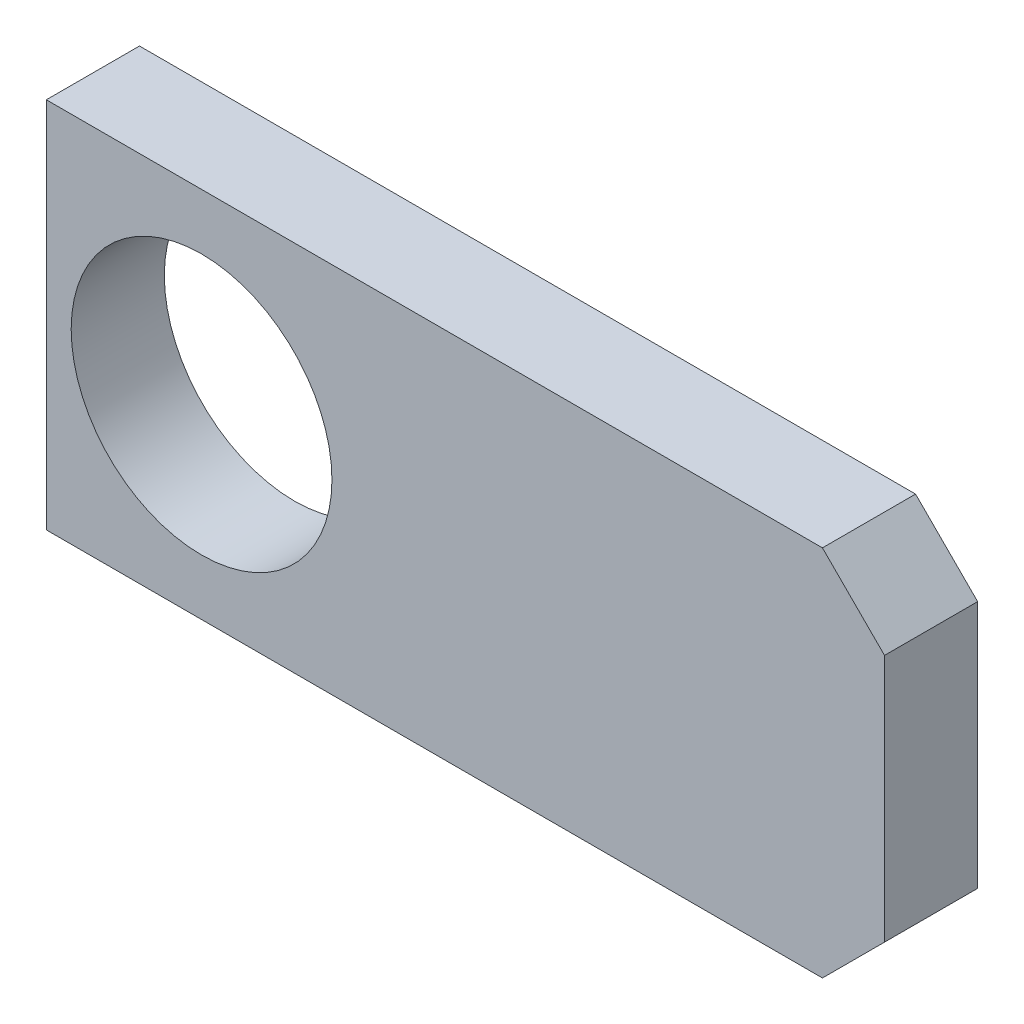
ISO-10303-21;
HEADER;
FILE_DESCRIPTION(('STEP AP214'),'2;1');
FILE_NAME('part.step','',(''),(''),'','','');
FILE_SCHEMA(('AUTOMOTIVE_DESIGN { 1 0 10303 214 1 1 1 1 }'));
ENDSEC;
DATA;
#1=APPLICATION_CONTEXT('core data for automotive mechanical design processes');
#2=APPLICATION_PROTOCOL_DEFINITION('international standard','automotive_design',2000,#1);
#3=PRODUCT_CONTEXT('',#1,'mechanical');
#4=PRODUCT('Part','Part','',(#3));
#5=PRODUCT_RELATED_PRODUCT_CATEGORY('part','',(#4));
#6=PRODUCT_DEFINITION_FORMATION('','',#4);
#7=PRODUCT_DEFINITION_CONTEXT('part definition',#1,'design');
#8=PRODUCT_DEFINITION('design','',#6,#7);
#9=PRODUCT_DEFINITION_SHAPE('','',#8);
#10=(LENGTH_UNIT() NAMED_UNIT(*) SI_UNIT(.MILLI.,.METRE.));
#11=(NAMED_UNIT(*) PLANE_ANGLE_UNIT() SI_UNIT($,.RADIAN.));
#12=(NAMED_UNIT(*) SI_UNIT($,.STERADIAN.) SOLID_ANGLE_UNIT());
#13=UNCERTAINTY_MEASURE_WITH_UNIT(LENGTH_MEASURE(1.E-05),#10,'distance_accuracy_value','');
#14=(GEOMETRIC_REPRESENTATION_CONTEXT(3) GLOBAL_UNCERTAINTY_ASSIGNED_CONTEXT((#13)) GLOBAL_UNIT_ASSIGNED_CONTEXT((#10,
#11,#12)) REPRESENTATION_CONTEXT('',''));
#15=CARTESIAN_POINT('',(0.,0.,0.));
#16=DIRECTION('',(0.,0.,1.));
#17=DIRECTION('',(1.,0.,0.));
#18=AXIS2_PLACEMENT_3D('',#15,#16,#17);
#19=CARTESIAN_POINT('',(0.,0.,15.));
#20=DIRECTION('',(1.,0.,0.));
#21=DIRECTION('',(0.,0.,-1.));
#22=AXIS2_PLACEMENT_3D('',#19,#20,#21);
#23=PLANE('',#22);
#24=DIRECTION('',(0.,-1.,0.));
#25=VECTOR('',#24,1.);
#26=CARTESIAN_POINT('',(0.,0.,0.));
#27=LINE('',#26,#25);
#28=CARTESIAN_POINT('',(0.,60.,0.));
#29=VERTEX_POINT('',#28);
#30=CARTESIAN_POINT('',(0.,0.,0.));
#31=VERTEX_POINT('',#30);
#32=EDGE_CURVE('E81',#29,#31,#27,.T.);
#33=ORIENTED_EDGE('',*,*,#32,.T.);
#34=DIRECTION('',(0.,0.,-1.));
#35=VECTOR('',#34,1.);
#36=CARTESIAN_POINT('',(0.,0.,15.));
#37=LINE('',#36,#35);
#38=CARTESIAN_POINT('',(0.,0.,15.));
#39=VERTEX_POINT('',#38);
#40=EDGE_CURVE('E87',#39,#31,#37,.T.);
#41=ORIENTED_EDGE('',*,*,#40,.F.);
#42=DIRECTION('',(0.,-1.,0.));
#43=VECTOR('',#42,1.);
#44=CARTESIAN_POINT('',(0.,0.,15.));
#45=LINE('',#44,#43);
#46=CARTESIAN_POINT('',(0.,60.,15.));
#47=VERTEX_POINT('',#46);
#48=EDGE_CURVE('E108',#47,#39,#45,.T.);
#49=ORIENTED_EDGE('',*,*,#48,.F.);
#50=DIRECTION('',(0.,0.,-1.));
#51=VECTOR('',#50,1.);
#52=CARTESIAN_POINT('',(0.,60.,15.));
#53=LINE('',#52,#51);
#54=EDGE_CURVE('E94',#47,#29,#53,.T.);
#55=ORIENTED_EDGE('',*,*,#54,.T.);
#56=EDGE_LOOP('',(#33,#41,#49,#55));
#57=FACE_BOUND('',#56,.T.);
#58=ADVANCED_FACE('F24',(#57),#23,.F.);
#59=CARTESIAN_POINT('',(0.,0.,15.));
#60=DIRECTION('',(0.,1.,0.));
#61=DIRECTION('',(0.,0.,1.));
#62=AXIS2_PLACEMENT_3D('',#59,#60,#61);
#63=PLANE('',#62);
#64=DIRECTION('',(1.,0.,0.));
#65=VECTOR('',#64,1.);
#66=CARTESIAN_POINT('',(0.,0.,0.));
#67=LINE('',#66,#65);
#68=CARTESIAN_POINT('',(125.,0.,0.));
#69=VERTEX_POINT('',#68);
#70=EDGE_CURVE('E76',#31,#69,#67,.T.);
#71=ORIENTED_EDGE('',*,*,#70,.T.);
#72=DIRECTION('',(0.,0.,1.));
#73=VECTOR('',#72,1.);
#74=CARTESIAN_POINT('',(125.,0.,15.));
#75=LINE('',#74,#73);
#76=CARTESIAN_POINT('',(125.,0.,15.));
#77=VERTEX_POINT('',#76);
#78=EDGE_CURVE('E11',#69,#77,#75,.T.);
#79=ORIENTED_EDGE('',*,*,#78,.T.);
#80=DIRECTION('',(1.,0.,0.));
#81=VECTOR('',#80,1.);
#82=CARTESIAN_POINT('',(0.,0.,15.));
#83=LINE('',#82,#81);
#84=EDGE_CURVE('E89',#39,#77,#83,.T.);
#85=ORIENTED_EDGE('',*,*,#84,.F.);
#86=ORIENTED_EDGE('',*,*,#40,.T.);
#87=EDGE_LOOP('',(#71,#79,#85,#86));
#88=FACE_BOUND('',#87,.T.);
#89=ADVANCED_FACE('F88',(#88),#63,.F.);
#90=CARTESIAN_POINT('',(135.,0.,15.));
#91=DIRECTION('',(-1.,0.,0.));
#92=DIRECTION('',(0.,0.,1.));
#93=AXIS2_PLACEMENT_3D('',#90,#91,#92);
#94=PLANE('',#93);
#95=DIRECTION('',(0.,1.,0.));
#96=VECTOR('',#95,1.);
#97=CARTESIAN_POINT('',(135.,0.,0.));
#98=LINE('',#97,#96);
#99=CARTESIAN_POINT('',(135.,10.,0.));
#100=VERTEX_POINT('',#99);
#101=CARTESIAN_POINT('',(135.,50.,0.));
#102=VERTEX_POINT('',#101);
#103=EDGE_CURVE('E84',#100,#102,#98,.T.);
#104=ORIENTED_EDGE('',*,*,#103,.T.);
#105=DIRECTION('',(0.,0.,1.));
#106=VECTOR('',#105,1.);
#107=CARTESIAN_POINT('',(135.,50.,15.));
#108=LINE('',#107,#106);
#109=CARTESIAN_POINT('',(135.,50.,15.));
#110=VERTEX_POINT('',#109);
#111=EDGE_CURVE('E44',#102,#110,#108,.T.);
#112=ORIENTED_EDGE('',*,*,#111,.T.);
#113=DIRECTION('',(0.,1.,0.));
#114=VECTOR('',#113,1.);
#115=CARTESIAN_POINT('',(135.,0.,15.));
#116=LINE('',#115,#114);
#117=CARTESIAN_POINT('',(135.,10.,15.));
#118=VERTEX_POINT('',#117);
#119=EDGE_CURVE('E111',#118,#110,#116,.T.);
#120=ORIENTED_EDGE('',*,*,#119,.F.);
#121=DIRECTION('',(0.,0.,-1.));
#122=VECTOR('',#121,1.);
#123=CARTESIAN_POINT('',(135.,10.,15.));
#124=LINE('',#123,#122);
#125=EDGE_CURVE('E121',#118,#100,#124,.T.);
#126=ORIENTED_EDGE('',*,*,#125,.T.);
#127=EDGE_LOOP('',(#104,#112,#120,#126));
#128=FACE_BOUND('',#127,.T.);
#129=ADVANCED_FACE('F135',(#128),#94,.F.);
#130=CARTESIAN_POINT('',(0.,60.,15.));
#131=DIRECTION('',(0.,-1.,0.));
#132=DIRECTION('',(0.,0.,-1.));
#133=AXIS2_PLACEMENT_3D('',#130,#131,#132);
#134=PLANE('',#133);
#135=DIRECTION('',(-1.,0.,0.));
#136=VECTOR('',#135,1.);
#137=CARTESIAN_POINT('',(0.,60.,15.));
#138=LINE('',#137,#136);
#139=CARTESIAN_POINT('',(125.,60.,15.));
#140=VERTEX_POINT('',#139);
#141=EDGE_CURVE('E113',#140,#47,#138,.T.);
#142=ORIENTED_EDGE('',*,*,#141,.F.);
#143=DIRECTION('',(0.,0.,-1.));
#144=VECTOR('',#143,1.);
#145=CARTESIAN_POINT('',(125.,60.,15.));
#146=LINE('',#145,#144);
#147=CARTESIAN_POINT('',(125.,60.,0.));
#148=VERTEX_POINT('',#147);
#149=EDGE_CURVE('E93',#140,#148,#146,.T.);
#150=ORIENTED_EDGE('',*,*,#149,.T.);
#151=DIRECTION('',(-1.,0.,0.));
#152=VECTOR('',#151,1.);
#153=CARTESIAN_POINT('',(0.,60.,0.));
#154=LINE('',#153,#152);
#155=EDGE_CURVE('E106',#148,#29,#154,.T.);
#156=ORIENTED_EDGE('',*,*,#155,.T.);
#157=ORIENTED_EDGE('',*,*,#54,.F.);
#158=EDGE_LOOP('',(#142,#150,#156,#157));
#159=FACE_BOUND('',#158,.T.);
#160=ADVANCED_FACE('F133',(#159),#134,.F.);
#161=CARTESIAN_POINT('',(0.,60.,15.));
#162=DIRECTION('',(0.,0.,-1.));
#163=DIRECTION('',(-1.,0.,0.));
#164=AXIS2_PLACEMENT_3D('',#161,#162,#163);
#165=PLANE('',#164);
#166=CARTESIAN_POINT('',(25.,30.,15.));
#167=DIRECTION('',(0.,0.,1.));
#168=DIRECTION('',(1.,0.,0.));
#169=AXIS2_PLACEMENT_3D('',#166,#167,#168);
#170=CIRCLE('',#169,21.);
#171=CARTESIAN_POINT('',(46.,30.,15.));
#172=VERTEX_POINT('',#171);
#173=EDGE_CURVE('E101',#172,#172,#170,.T.);
#174=ORIENTED_EDGE('',*,*,#173,.F.);
#175=EDGE_LOOP('',(#174));
#176=FACE_BOUND('',#175,.T.);
#177=ORIENTED_EDGE('',*,*,#119,.T.);
#178=DIRECTION('',(0.707106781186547,-0.707106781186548,0.));
#179=VECTOR('',#178,1.);
#180=CARTESIAN_POINT('',(125.,60.,15.));
#181=LINE('',#180,#179);
#182=EDGE_CURVE('E31',#110,#140,#181,.F.);
#183=ORIENTED_EDGE('',*,*,#182,.T.);
#184=ORIENTED_EDGE('',*,*,#141,.T.);
#185=ORIENTED_EDGE('',*,*,#48,.T.);
#186=ORIENTED_EDGE('',*,*,#84,.T.);
#187=DIRECTION('',(-0.707106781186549,-0.707106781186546,0.));
#188=VECTOR('',#187,1.);
#189=CARTESIAN_POINT('',(135.,10.,15.));
#190=LINE('',#189,#188);
#191=EDGE_CURVE('E125',#77,#118,#190,.F.);
#192=ORIENTED_EDGE('',*,*,#191,.T.);
#193=EDGE_LOOP('',(#177,#183,#184,#185,#186,#192));
#194=FACE_BOUND('',#193,.T.);
#195=ADVANCED_FACE('F129',(#176,#194),#165,.F.);
#196=CARTESIAN_POINT('',(0.,60.,0.));
#197=DIRECTION('',(0.,0.,-1.));
#198=DIRECTION('',(-1.,0.,0.));
#199=AXIS2_PLACEMENT_3D('',#196,#197,#198);
#200=PLANE('',#199);
#201=CARTESIAN_POINT('',(25.,30.,0.));
#202=DIRECTION('',(0.,0.,1.));
#203=DIRECTION('',(1.,0.,0.));
#204=AXIS2_PLACEMENT_3D('',#201,#202,#203);
#205=CIRCLE('',#204,21.);
#206=CARTESIAN_POINT('',(46.,30.,0.));
#207=VERTEX_POINT('',#206);
#208=EDGE_CURVE('E98',#207,#207,#205,.T.);
#209=ORIENTED_EDGE('',*,*,#208,.T.);
#210=EDGE_LOOP('',(#209));
#211=FACE_BOUND('',#210,.T.);
#212=ORIENTED_EDGE('',*,*,#155,.F.);
#213=DIRECTION('',(-0.707106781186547,0.707106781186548,0.));
#214=VECTOR('',#213,1.);
#215=CARTESIAN_POINT('',(62.5000000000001,122.5,0.));
#216=LINE('',#215,#214);
#217=EDGE_CURVE('E119',#148,#102,#216,.F.);
#218=ORIENTED_EDGE('',*,*,#217,.T.);
#219=ORIENTED_EDGE('',*,*,#103,.F.);
#220=DIRECTION('',(0.707106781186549,0.707106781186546,0.));
#221=VECTOR('',#220,1.);
#222=CARTESIAN_POINT('',(92.4999999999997,-32.5000000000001,0.));
#223=LINE('',#222,#221);
#224=EDGE_CURVE('E83',#100,#69,#223,.F.);
#225=ORIENTED_EDGE('',*,*,#224,.T.);
#226=ORIENTED_EDGE('',*,*,#70,.F.);
#227=ORIENTED_EDGE('',*,*,#32,.F.);
#228=EDGE_LOOP('',(#212,#218,#219,#225,#226,#227));
#229=FACE_BOUND('',#228,.T.);
#230=ADVANCED_FACE('F79',(#211,#229),#200,.T.);
#231=CARTESIAN_POINT('',(25.,30.,0.));
#232=DIRECTION('',(0.,0.,1.));
#233=DIRECTION('',(1.,0.,0.));
#234=AXIS2_PLACEMENT_3D('',#231,#232,#233);
#235=CYLINDRICAL_SURFACE('',#234,21.);
#236=ORIENTED_EDGE('',*,*,#208,.F.);
#237=EDGE_LOOP('',(#236));
#238=FACE_BOUND('',#237,.T.);
#239=ORIENTED_EDGE('',*,*,#173,.T.);
#240=EDGE_LOOP('',(#239));
#241=FACE_BOUND('',#240,.T.);
#242=ADVANCED_FACE('F145',(#238,#241),#235,.F.);
#243=CARTESIAN_POINT('',(125.,60.,15.));
#244=DIRECTION('',(-0.707106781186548,-0.707106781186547,0.));
#245=DIRECTION('',(0.707106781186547,-0.707106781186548,0.));
#246=AXIS2_PLACEMENT_3D('',#243,#244,#245);
#247=PLANE('',#246);
#248=ORIENTED_EDGE('',*,*,#182,.F.);
#249=ORIENTED_EDGE('',*,*,#111,.F.);
#250=ORIENTED_EDGE('',*,*,#217,.F.);
#251=ORIENTED_EDGE('',*,*,#149,.F.);
#252=EDGE_LOOP('',(#248,#249,#250,#251));
#253=FACE_BOUND('',#252,.T.);
#254=ADVANCED_FACE('F134',(#253),#247,.F.);
#255=CARTESIAN_POINT('',(135.,10.,15.));
#256=DIRECTION('',(-0.707106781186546,0.707106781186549,0.));
#257=DIRECTION('',(-0.707106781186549,-0.707106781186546,0.));
#258=AXIS2_PLACEMENT_3D('',#255,#256,#257);
#259=PLANE('',#258);
#260=ORIENTED_EDGE('',*,*,#191,.F.);
#261=ORIENTED_EDGE('',*,*,#78,.F.);
#262=ORIENTED_EDGE('',*,*,#224,.F.);
#263=ORIENTED_EDGE('',*,*,#125,.F.);
#264=EDGE_LOOP('',(#260,#261,#262,#263));
#265=FACE_BOUND('',#264,.T.);
#266=ADVANCED_FACE('F139',(#265),#259,.F.);
#267=CLOSED_SHELL('',(#58,#89,#129,#160,#195,#230,#242,#254,#266));
#268=MANIFOLD_SOLID_BREP('B2',#267);
#269=ADVANCED_BREP_SHAPE_REPRESENTATION('',(#18,#268),#14);
#270=SHAPE_DEFINITION_REPRESENTATION(#9,#269);
ENDSEC;
END-ISO-10303-21;
